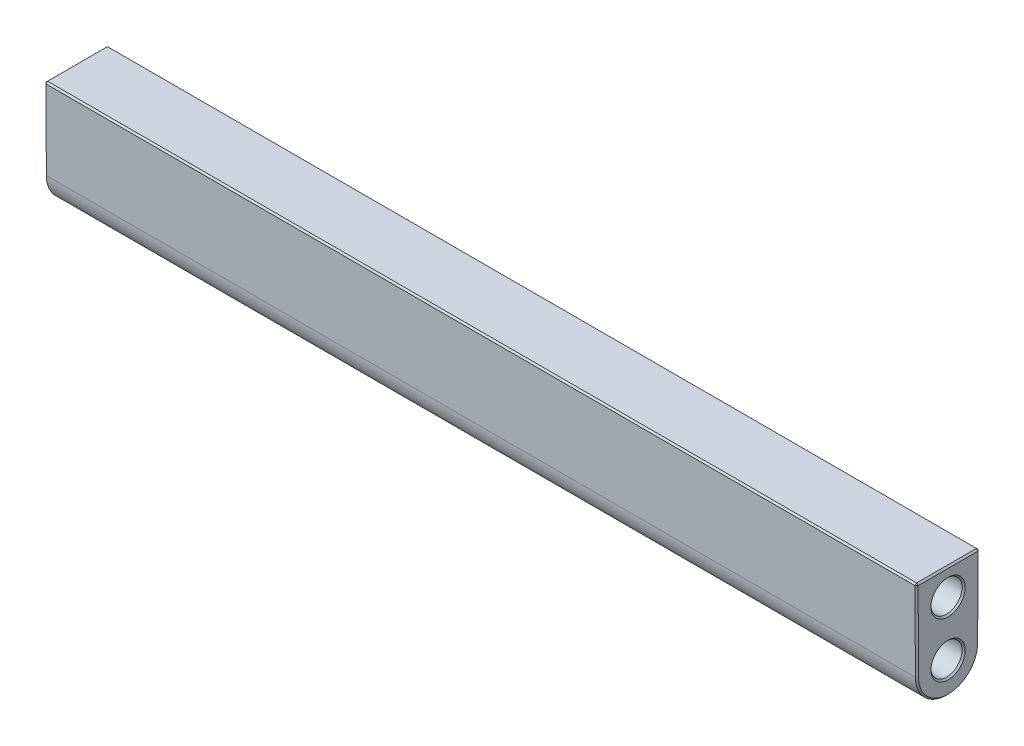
from build123d import *
from OCP.BRepFilletAPI import BRepFilletAPI_MakeChamfer

# Parameters (mm, degrees)
EXTRUDE_1_DEPTH     = 140
SKETCH_2_R          = 5
CUT_EXTRUDE_1_DEPTH = 20
CHAMFER_1_SIZE      = 0.5
CHAMFER_1_SIZE2     = 0.49789968


with BuildPart() as part:
    # Sketch 1 → Extrude 1 (new, symmetric)
    with BuildSketch(Plane(origin=(0, 0, 0), x_dir=(0, 0, -1), z_dir=(1, 0, 0))):
        with BuildLine():
            Line((-10.11, 26), (-9.999910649, -0.042272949))
            ThreePointArc((-9.999910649, -0.042272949), (0, -10), (9.999910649, -0.042272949))
            Line((9.999910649, -0.042272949), (10.11, 26))
            Line((10.11, 26), (-10.11, 26))
        make_face()
    extrude(amount=EXTRUDE_1_DEPTH, both=True)

    # Sketch 2 → Cut-Extrude 1 (cut)
    with BuildSketch(Plane(origin=(140, 0, 0), x_dir=(0, 0, -1), z_dir=(1, 0, 0))):
        Circle(SKETCH_2_R)
        with Locations((0, 17.5)):
            Circle(SKETCH_2_R)
    cut_extrude_1 = extrude(amount=-CUT_EXTRUDE_1_DEPTH, mode=Mode.SUBTRACT)

    # Mirror 1: Cut-Extrude 1 across plane
    add(cut_extrude_1.mirror(Plane(origin=(0, 0, 0), x_dir=(0, 0, 1), z_dir=(1, 0, 0))), mode=Mode.SUBTRACT)

    # Chamfer 1: one chamfer whose edges measure the first distance from different faces: ONE call of the kernel's chamfer builder (chamfer() names one face for all edges)
    chamfer_1_edges_1 = [part.edges().sort_by_distance(p)[0] for p in [
        (140, 26, 0),
        (140, 12.978863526, 10.054955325),
        (120, 0, 5),
        (140, 0, 5),
        (120, 17.5, 5),
        (140, 17.5, 5),
        (-140, 0, 5),
        (-120, 0, 5),
        (-140, 17.5, 5),
        (-120, 17.5, 5),
        (140, -10, 0),
        (-140, 12.978863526, 10.054955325),
        (-140, 26, 0),
        (-140, 12.978863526, -10.054955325),
        (-140, -10, 0),
        (140, 12.978863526, -10.054955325),
    ]]
    chamfer_1_edges_2 = [part.edges().sort_by_distance(p)[0] for p in [
        (0, 26, 10.11),
    ]]
    chamfer_1_side_2 = [part.faces().sort_by_distance(p)[0] for p in [
        (0, 26, 0),
    ]]
    chamfer_1_edges_3 = [part.edges().sort_by_distance(p)[0] for p in [
        (0, 26, -10.11),
    ]]
    chamfer_1_side_3 = [part.faces().sort_by_distance(p)[0] for p in [
        (0, 12.978863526, -10.054955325),
    ]]
    chamfer_1 = BRepFilletAPI_MakeChamfer(part.part.solid().wrapped)
    for e in chamfer_1_edges_1:
        chamfer_1.Add(CHAMFER_1_SIZE, e.wrapped)
    for e in chamfer_1_edges_2:
        chamfer_1.Add(CHAMFER_1_SIZE, CHAMFER_1_SIZE2, e.wrapped, chamfer_1_side_2[0].wrapped)  # the first distance lies on this face
    for e in chamfer_1_edges_3:
        chamfer_1.Add(CHAMFER_1_SIZE, CHAMFER_1_SIZE2, e.wrapped, chamfer_1_side_3[0].wrapped)  # the first distance lies on this face
    add(Compound.cast(chamfer_1.Shape()), mode=Mode.REPLACE)


solid = part.part
